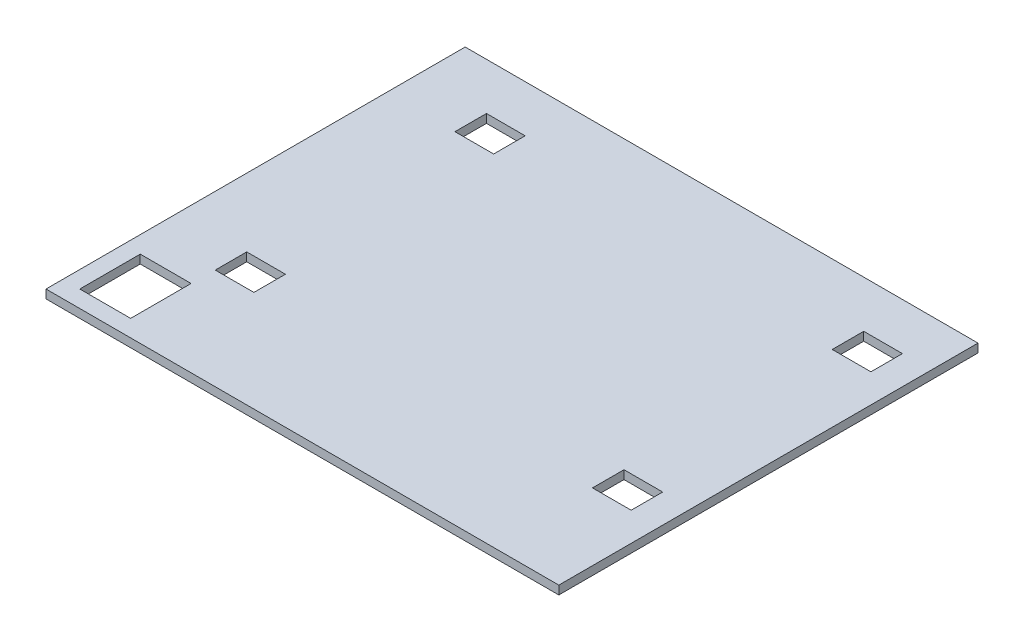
from build123d import *

# Parameters (mm, degrees)
SKETCH1_W           = 350
SKETCH1_H           = 350
BOSS_EXTRUDE1_DEPTH = 6.35
SKETCH2_W           = 28.6
SKETCH2_H           = 23.3
CUT_EXTRUDE1_DEPTH  = 10
SKETCH4_W           = 29.25
SKETCH4_H           = 350
BOSS_EXTRUDE2_DEPTH = 6.35
SKETCH3_W           = 37.6
SKETCH3_H           = 44.7
CUT_EXTRUDE2_DEPTH  = 45
SKETCH5_W           = 379.25
SKETCH5_H           = 40
CUT_EXTRUDE3_DEPTH  = 10


with BuildPart() as part:
    # Sketch1 → Boss-Extrude1 (new body)
    with BuildSketch(Plane(origin=(0, 0, 0), x_dir=(1, 0, 0), z_dir=(0, 1, 0))):
        Rectangle(SKETCH1_W, SKETCH1_H)
    extrude(amount=BOSS_EXTRUDE1_DEPTH)

    # Sketch2 → Cut-Extrude1 (cut)
    with BuildSketch(Plane(origin=(0, 6.35, 0), x_dir=(1, 0, 0), z_dir=(0, 1, 0))):
        with Locations((-139.5, 88.65)):
            Rectangle(SKETCH2_W, SKETCH2_H)
        with Locations((-139.5, -88.65)):
            Rectangle(SKETCH2_W, SKETCH2_H)
        with Locations((139.5, 88.65)):
            Rectangle(SKETCH2_W, SKETCH2_H)
        with Locations((139.5, -88.65)):
            Rectangle(SKETCH2_W, SKETCH2_H)
    extrude(amount=-CUT_EXTRUDE1_DEPTH, mode=Mode.SUBTRACT)

    # Sketch4 → Boss-Extrude2 (add)
    with BuildSketch(Plane(origin=(0, 6.35, 0), x_dir=(1, 0, 0), z_dir=(0, 1, 0))):
        with Locations((-189.625, 0)):
            Rectangle(SKETCH4_W, SKETCH4_H)
    extrude(amount=-BOSS_EXTRUDE2_DEPTH)

    # Sketch3 → Cut-Extrude2 (cut)
    with BuildSketch(Plane(origin=(0, 6.35, 0), x_dir=(1, 0, 0), z_dir=(0, 1, 0))):
        with Locations((-172.95, -140.15)):
            Rectangle(SKETCH3_W, SKETCH3_H)
    extrude(amount=-CUT_EXTRUDE2_DEPTH, mode=Mode.SUBTRACT)

    # Sketch5 → Cut-Extrude3 (cut)
    with BuildSketch(Plane(origin=(0, 6.35, 0), x_dir=(1, 0, 0), z_dir=(0, 1, 0))):
        with Locations((-14.625, 155)):
            Rectangle(SKETCH5_W, SKETCH5_H)
    extrude(amount=-CUT_EXTRUDE3_DEPTH, mode=Mode.SUBTRACT)


solid = part.part
